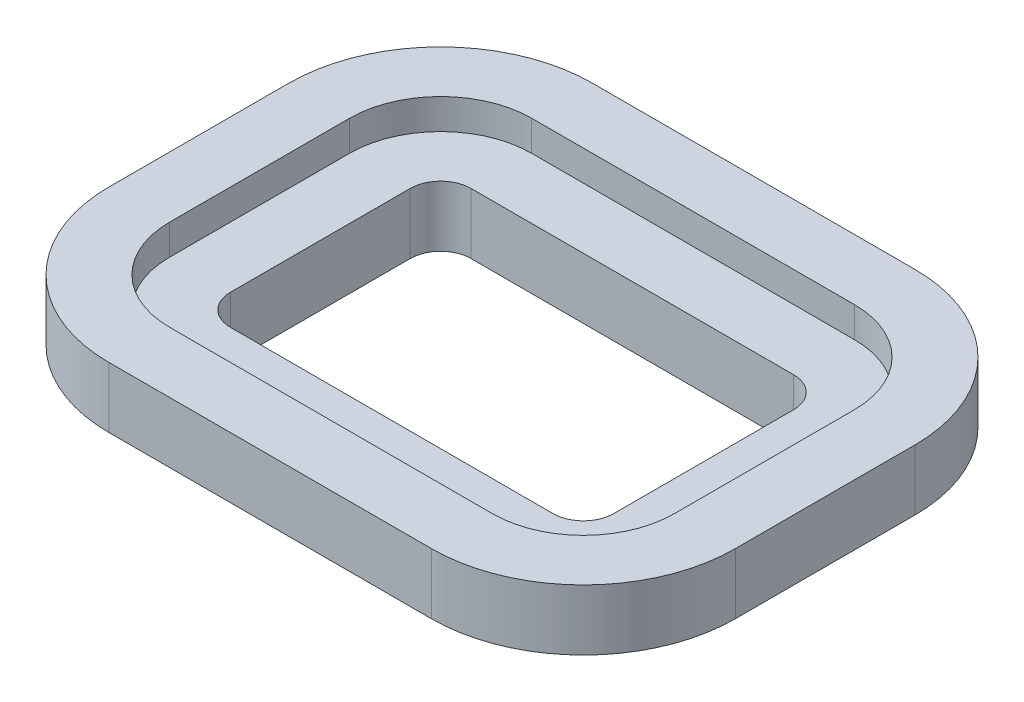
from build123d import *


with BuildPart() as part:
    # Sweep1: sweep along a path in Sketch1
    with BuildLine(Plane(origin=(0, 0, 0), x_dir=(1, 0, 0), z_dir=(0, 1, 0))) as sweep1_path:
        Line((10, 0), (116.208722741, 0))
        ThreePointArc((116.208722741, 0), (123.279790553, 2.928932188), (126.208722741, 10))
        Line((126.208722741, 10), (126.208722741, 69.206853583))
        ThreePointArc((126.208722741, 69.206853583), (123.279790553, 76.277921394), (116.208722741, 79.206853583))
        Line((116.208722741, 79.206853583), (10, 79.206853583))
        ThreePointArc((10, 79.206853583), (2.928932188, 76.277921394), (0, 69.206853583))
        Line((0, 69.206853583), (0, 10))
        ThreePointArc((0, 10), (2.928932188, 2.928932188), (10, 0))
    # Sketch2 → Sweep1 (sweep)
    with BuildSketch(Plane(origin=(116.208722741, 0, 0), x_dir=(0, 0, -1), z_dir=(1, 0, 0))):
        Polygon((0, 0), (0, -20), (-20, -20), (-20, -10), (-40, -10), (-40, 10), (-20, 10), (-20, 0), align=None)
    sweep(path=sweep1_path.line)


solid = part.part
